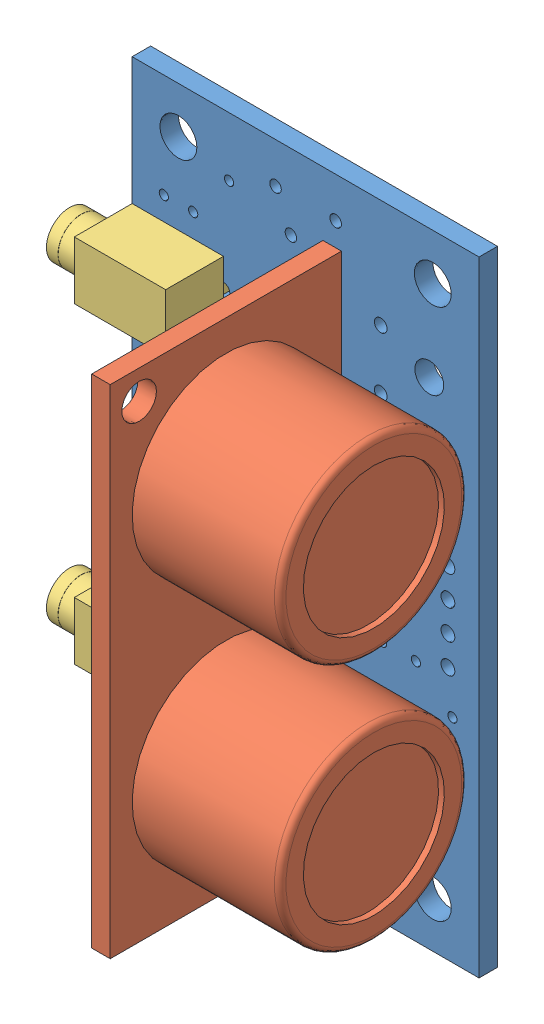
SolidWorks assembly Module Capteur mesure de distance K-AP-MUS.SLDASM, configuration Défaut (file format 3400). Lengths in mm.
Overall size (33.81 54 23.01).
4 component instances, 3 part files, 0 mates.
Components (placement in the parent):
- CI AP-EIR-1: CI AP-EIR.sldprt [Défaut] at (-18.5974 -26.9012 0) size (30 54 1.6)
- Capteur UltraSon-1: Capteur UltraSon.sldprt [Défaut] at (-2.0941 -21.4111 1.6) x (0 1 0) z (1 0 0) size (43 22 20.2)
- Embase jack 2.5-1: Embase jack 2.5.sldprt [Défaut] at (-18.5974 13.5991 1.6) x (1 0 0) z (0 -1 0) size (10.81 8.01 5)
- Embase jack 2.5-2: Embase jack 2.5.sldprt [Défaut] at (-18.5974 -13.4011 1.6) x (1 0 0) z (0 -1 0) size (10.81 8.01 5)
